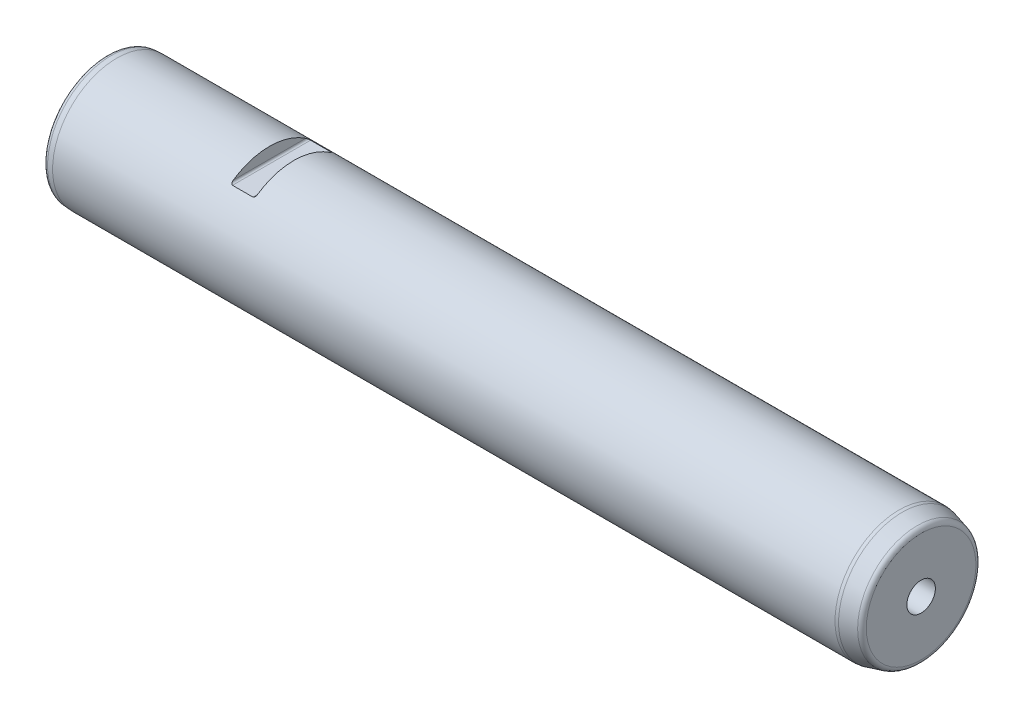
ISO-10303-21;
HEADER;
FILE_DESCRIPTION(('STEP AP214'),'2;1');
FILE_NAME('part.step','',(''),(''),'','','');
FILE_SCHEMA(('AUTOMOTIVE_DESIGN { 1 0 10303 214 1 1 1 1 }'));
ENDSEC;
DATA;
#1=APPLICATION_CONTEXT('core data for automotive mechanical design processes');
#2=APPLICATION_PROTOCOL_DEFINITION('international standard','automotive_design',2000,#1);
#3=PRODUCT_CONTEXT('',#1,'mechanical');
#4=PRODUCT('Part','Part','',(#3));
#5=PRODUCT_RELATED_PRODUCT_CATEGORY('part','',(#4));
#6=PRODUCT_DEFINITION_FORMATION('','',#4);
#7=PRODUCT_DEFINITION_CONTEXT('part definition',#1,'design');
#8=PRODUCT_DEFINITION('design','',#6,#7);
#9=PRODUCT_DEFINITION_SHAPE('','',#8);
#10=(LENGTH_UNIT() NAMED_UNIT(*) SI_UNIT(.MILLI.,.METRE.));
#11=(NAMED_UNIT(*) PLANE_ANGLE_UNIT() SI_UNIT($,.RADIAN.));
#12=(NAMED_UNIT(*) SI_UNIT($,.STERADIAN.) SOLID_ANGLE_UNIT());
#13=UNCERTAINTY_MEASURE_WITH_UNIT(LENGTH_MEASURE(1.E-05),#10,'distance_accuracy_value','');
#14=(GEOMETRIC_REPRESENTATION_CONTEXT(3) GLOBAL_UNCERTAINTY_ASSIGNED_CONTEXT((#13)) GLOBAL_UNIT_ASSIGNED_CONTEXT((#10,
#11,#12)) REPRESENTATION_CONTEXT('',''));
#15=CARTESIAN_POINT('',(0.,0.,0.));
#16=DIRECTION('',(0.,0.,1.));
#17=DIRECTION('',(1.,0.,0.));
#18=AXIS2_PLACEMENT_3D('',#15,#16,#17);
#19=CARTESIAN_POINT('',(0.,0.,0.));
#20=DIRECTION('',(1.,0.,0.));
#21=DIRECTION('',(0.,0.,-1.));
#22=AXIS2_PLACEMENT_3D('',#19,#20,#21);
#23=PLANE('',#22);
#24=CARTESIAN_POINT('',(0.,0.,0.));
#25=DIRECTION('',(1.,0.,0.));
#26=DIRECTION('',(0.,0.,-1.));
#27=AXIS2_PLACEMENT_3D('',#24,#25,#26);
#28=CIRCLE('',#27,28.771728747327);
#29=CARTESIAN_POINT('',(0.,0.,-28.771728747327));
#30=VERTEX_POINT('',#29);
#31=EDGE_CURVE('E160',#30,#30,#28,.F.);
#32=ORIENTED_EDGE('',*,*,#31,.T.);
#33=EDGE_LOOP('',(#32));
#34=FACE_BOUND('',#33,.T.);
#35=ADVANCED_FACE('F15',(#34),#23,.F.);
#36=CARTESIAN_POINT('',(0.,0.,0.));
#37=DIRECTION('',(-1.,0.,0.));
#38=DIRECTION('',(0.,0.,1.));
#39=AXIS2_PLACEMENT_3D('',#36,#37,#38);
#40=CYLINDRICAL_SURFACE('',#39,31.5);
#41=CARTESIAN_POINT('',(91.,25.,-19.1637678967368));
#42=CARTESIAN_POINT('',(91.0206021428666,24.9999962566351,-19.1637724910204));
#43=CARTESIAN_POINT('',(91.0411895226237,25.000637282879,-19.1629365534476));
#44=CARTESIAN_POINT('',(91.0821323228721,25.0031684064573,-19.1596340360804));
#45=CARTESIAN_POINT('',(91.1024879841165,25.0050570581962,-19.1571693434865));
#46=CARTESIAN_POINT('',(91.1624864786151,25.0124756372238,-19.1474836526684));
#47=CARTESIAN_POINT('',(91.2015690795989,25.0197603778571,-19.1379682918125));
#48=CARTESIAN_POINT('',(91.2768030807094,25.0382921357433,-19.1137163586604));
#49=CARTESIAN_POINT('',(91.3129662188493,25.0495222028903,-19.0990021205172));
#50=CARTESIAN_POINT('',(91.3821411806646,25.0751576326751,-19.0653329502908));
#51=CARTESIAN_POINT('',(91.4151429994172,25.0895726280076,-19.0463651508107));
#52=CARTESIAN_POINT('',(91.4940924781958,25.1289598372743,-18.9943915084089));
#53=CARTESIAN_POINT('',(91.5378167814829,25.1555174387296,-18.9592231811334));
#54=CARTESIAN_POINT('',(91.6178752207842,25.2121909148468,-18.8837940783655));
#55=CARTESIAN_POINT('',(91.654194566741,25.2423137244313,-18.8435233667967));
#56=CARTESIAN_POINT('',(91.7400427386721,25.323512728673,-18.7343708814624));
#57=CARTESIAN_POINT('',(91.7844613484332,25.3763362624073,-18.6627946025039));
#58=CARTESIAN_POINT('',(91.8595737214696,25.4847393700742,-18.5144966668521));
#59=CARTESIAN_POINT('',(91.8902090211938,25.5403295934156,-18.437754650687));
#60=CARTESIAN_POINT('',(91.9297784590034,25.6300581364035,-18.3126586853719));
#61=CARTESIAN_POINT('',(91.9424916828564,25.6638849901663,-18.2652250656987));
#62=CARTESIAN_POINT('',(91.963993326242,25.7317021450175,-18.1695608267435));
#63=CARTESIAN_POINT('',(91.9727802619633,25.7656925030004,-18.121329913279));
#64=CARTESIAN_POINT('',(91.9865826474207,25.8331875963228,-18.0249779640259));
#65=CARTESIAN_POINT('',(91.9916469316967,25.866692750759,-17.9768640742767));
#66=CARTESIAN_POINT('',(91.9983485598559,25.9335124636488,-17.8803351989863));
#67=CARTESIAN_POINT('',(91.9999892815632,25.9668271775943,-17.8319205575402));
#68=CARTESIAN_POINT('',(92.,26.,-17.7834192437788));
#69=B_SPLINE_CURVE_WITH_KNOTS('',3,(#41,#42,#43,#44,#45,#46,#47,#48,#49,#50,#51,#52,#53,#54,#55,
#56,#57,#58,#59,#60,#61,#62,#63,#64,#65,#66,#67,#68),.UNSPECIFIED.,.F.,.F.,(4,2,2,2,2,2,2,2,2,2,
2,2,2,4),(0.,0.0617521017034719,0.123432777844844,0.245296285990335,0.366642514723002,
0.488360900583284,0.673551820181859,0.859109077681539,1.15576169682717,1.45366100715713,
1.63242917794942,1.81126485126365,1.98771047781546,2.16398193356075),.UNSPECIFIED.);
#70=CARTESIAN_POINT('',(91.,25.,-19.1637678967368));
#71=VERTEX_POINT('',#70);
#72=CARTESIAN_POINT('',(92.,26.,-17.7834192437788));
#73=VERTEX_POINT('',#72);
#74=EDGE_CURVE('E206',#71,#73,#69,.T.);
#75=ORIENTED_EDGE('',*,*,#74,.T.);
#76=CARTESIAN_POINT('',(92.,0.,0.));
#77=DIRECTION('',(1.,0.,0.));
#78=DIRECTION('',(0.,0.,-1.));
#79=AXIS2_PLACEMENT_3D('',#76,#77,#78);
#80=CIRCLE('',#79,31.5);
#81=CARTESIAN_POINT('',(92.,26.,17.7834192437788));
#82=VERTEX_POINT('',#81);
#83=EDGE_CURVE('E9',#73,#82,#80,.T.);
#84=ORIENTED_EDGE('',*,*,#83,.T.);
#85=CARTESIAN_POINT('',(92.,26.,17.7834192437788));
#86=CARTESIAN_POINT('',(91.9999572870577,25.9536837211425,17.8511416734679));
#87=CARTESIAN_POINT('',(91.9967773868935,25.9070697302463,17.9187190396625));
#88=CARTESIAN_POINT('',(91.98359435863,25.8134163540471,18.0533717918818));
#89=CARTESIAN_POINT('',(91.9735592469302,25.7663759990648,18.1204433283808));
#90=CARTESIAN_POINT('',(91.9459716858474,25.672018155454,18.2538828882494));
#91=CARTESIAN_POINT('',(91.9283458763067,25.6247025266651,18.3202373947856));
#92=CARTESIAN_POINT('',(91.8846961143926,25.5309760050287,18.450628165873));
#93=CARTESIAN_POINT('',(91.8586908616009,25.4845633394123,18.5146692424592));
#94=CARTESIAN_POINT('',(91.8035708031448,25.4032208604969,18.6260588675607));
#95=CARTESIAN_POINT('',(91.7762945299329,25.3679487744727,18.6740601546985));
#96=CARTESIAN_POINT('',(91.7149053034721,25.2992635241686,18.7670081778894));
#97=CARTESIAN_POINT('',(91.6807928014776,25.2658502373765,18.8119551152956));
#98=CARTESIAN_POINT('',(91.6042482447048,25.2016125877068,18.8979268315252));
#99=CARTESIAN_POINT('',(91.5617053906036,25.1708315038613,18.9388871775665));
#100=CARTESIAN_POINT('',(91.4677411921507,25.1144557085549,19.0135816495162));
#101=CARTESIAN_POINT('',(91.4163575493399,25.0888399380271,19.0473451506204));
#102=CARTESIAN_POINT('',(91.3286773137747,25.0549354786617,19.0918997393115));
#103=CARTESIAN_POINT('',(91.2952896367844,25.0439158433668,19.1063475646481));
#104=CARTESIAN_POINT('',(91.2260723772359,25.0252341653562,19.1308099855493));
#105=CARTESIAN_POINT('',(91.1902489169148,25.0175640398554,19.1408352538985));
#106=CARTESIAN_POINT('',(91.1285741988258,25.0079765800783,19.1533587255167));
#107=CARTESIAN_POINT('',(91.1031595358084,25.0050065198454,19.1572353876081));
#108=CARTESIAN_POINT('',(91.0518392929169,25.001008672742,19.1624520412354));
#109=CARTESIAN_POINT('',(91.0259323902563,24.9999872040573,19.1637837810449));
#110=CARTESIAN_POINT('',(91.,25.,19.1637678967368));
#111=B_SPLINE_CURVE_WITH_KNOTS('',3,(#85,#86,#87,#88,#89,#90,#91,#92,#93,#94,#95,#96,#97,#98,
#99,#100,#101,#102,#103,#104,#105,#106,#107,#108,#109,#110),.UNSPECIFIED.,.F.,.F.,(4,2,2,2,2,2,
2,2,2,2,2,2,4),(0.,0.2461520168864,0.493460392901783,0.743214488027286,0.992415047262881,
1.18859975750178,1.38477152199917,1.58371665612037,1.78183351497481,1.8954759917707,
2.00884269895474,2.0862906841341,2.16398936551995),.UNSPECIFIED.);
#112=CARTESIAN_POINT('',(91.,25.,19.1637678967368));
#113=VERTEX_POINT('',#112);
#114=EDGE_CURVE('E23',#82,#113,#111,.T.);
#115=ORIENTED_EDGE('',*,*,#114,.T.);
#116=DIRECTION('',(-1.,0.,0.));
#117=VECTOR('',#116,1.);
#118=CARTESIAN_POINT('',(0.,25.,19.1637678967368));
#119=LINE('',#118,#117);
#120=CARTESIAN_POINT('',(81.,25.,19.1637678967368));
#121=VERTEX_POINT('',#120);
#122=EDGE_CURVE('E74',#113,#121,#119,.T.);
#123=ORIENTED_EDGE('',*,*,#122,.T.);
#124=CARTESIAN_POINT('',(81.,25.,19.1637678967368));
#125=CARTESIAN_POINT('',(80.9793978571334,24.9999962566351,19.1637724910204));
#126=CARTESIAN_POINT('',(80.9588104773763,25.000637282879,19.1629365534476));
#127=CARTESIAN_POINT('',(80.9178676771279,25.0031684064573,19.1596340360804));
#128=CARTESIAN_POINT('',(80.8975120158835,25.0050570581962,19.1571693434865));
#129=CARTESIAN_POINT('',(80.8375135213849,25.0124756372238,19.1474836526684));
#130=CARTESIAN_POINT('',(80.7984309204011,25.0197603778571,19.1379682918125));
#131=CARTESIAN_POINT('',(80.7231969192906,25.0382921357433,19.1137163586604));
#132=CARTESIAN_POINT('',(80.6870337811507,25.0495222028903,19.0990021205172));
#133=CARTESIAN_POINT('',(80.6178588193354,25.0751576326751,19.0653329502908));
#134=CARTESIAN_POINT('',(80.5848570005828,25.0895726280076,19.0463651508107));
#135=CARTESIAN_POINT('',(80.5059075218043,25.1289598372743,18.9943915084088));
#136=CARTESIAN_POINT('',(80.4621832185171,25.1555174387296,18.9592231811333));
#137=CARTESIAN_POINT('',(80.3821247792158,25.2121909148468,18.8837940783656));
#138=CARTESIAN_POINT('',(80.345805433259,25.2423137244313,18.8435233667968));
#139=CARTESIAN_POINT('',(80.2599572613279,25.3235127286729,18.7343708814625));
#140=CARTESIAN_POINT('',(80.2155386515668,25.3763362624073,18.662794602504));
#141=CARTESIAN_POINT('',(80.1404262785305,25.4847393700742,18.5144966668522));
#142=CARTESIAN_POINT('',(80.1097909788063,25.5403295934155,18.437754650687));
#143=CARTESIAN_POINT('',(80.0702215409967,25.6300581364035,18.3126586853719));
#144=CARTESIAN_POINT('',(80.0575083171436,25.6638849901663,18.2652250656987));
#145=CARTESIAN_POINT('',(80.0360066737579,25.7317021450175,18.1695608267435));
#146=CARTESIAN_POINT('',(80.0272197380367,25.7656925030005,18.121329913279));
#147=CARTESIAN_POINT('',(80.0134173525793,25.8331875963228,18.0249779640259));
#148=CARTESIAN_POINT('',(80.0083530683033,25.866692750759,17.9768640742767));
#149=CARTESIAN_POINT('',(80.0016514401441,25.9335124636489,17.8803351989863));
#150=CARTESIAN_POINT('',(80.0000107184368,25.9668271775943,17.8319205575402));
#151=CARTESIAN_POINT('',(80.,26.,17.7834192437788));
#152=B_SPLINE_CURVE_WITH_KNOTS('',3,(#124,#125,#126,#127,#128,#129,#130,#131,#132,#133,#134,
#135,#136,#137,#138,#139,#140,#141,#142,#143,#144,#145,#146,#147,#148,#149,#150,#151),
.UNSPECIFIED.,.F.,.F.,(4,2,2,2,2,2,2,2,2,2,2,2,2,4),(0.,0.061752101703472,0.123432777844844,
0.245296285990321,0.366642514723,0.488360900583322,0.673551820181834,0.859109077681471,
1.15576169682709,1.45366100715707,1.6324291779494,1.81126485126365,1.98771047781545,
2.16398193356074),.UNSPECIFIED.);
#153=CARTESIAN_POINT('',(80.,26.,17.7834192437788));
#154=VERTEX_POINT('',#153);
#155=EDGE_CURVE('E65',#121,#154,#152,.T.);
#156=ORIENTED_EDGE('',*,*,#155,.T.);
#157=CARTESIAN_POINT('',(80.,0.,0.));
#158=DIRECTION('',(-1.,0.,0.));
#159=DIRECTION('',(0.,-1.,0.));
#160=AXIS2_PLACEMENT_3D('',#157,#158,#159);
#161=CIRCLE('',#160,31.5);
#162=CARTESIAN_POINT('',(80.,26.,-17.7834192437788));
#163=VERTEX_POINT('',#162);
#164=EDGE_CURVE('E54',#154,#163,#161,.T.);
#165=ORIENTED_EDGE('',*,*,#164,.T.);
#166=CARTESIAN_POINT('',(80.,26.,-17.7834192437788));
#167=CARTESIAN_POINT('',(80.0000427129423,25.9536837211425,-17.8511416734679));
#168=CARTESIAN_POINT('',(80.0032226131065,25.9070697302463,-17.9187190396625));
#169=CARTESIAN_POINT('',(80.01640564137,25.8134163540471,-18.0533717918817));
#170=CARTESIAN_POINT('',(80.0264407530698,25.7663759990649,-18.1204433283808));
#171=CARTESIAN_POINT('',(80.0540283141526,25.672018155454,-18.2538828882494));
#172=CARTESIAN_POINT('',(80.0716541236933,25.6247025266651,-18.3202373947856));
#173=CARTESIAN_POINT('',(80.1153038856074,25.5309760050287,-18.450628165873));
#174=CARTESIAN_POINT('',(80.1413091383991,25.4845633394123,-18.5146692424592));
#175=CARTESIAN_POINT('',(80.1964291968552,25.4032208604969,-18.6260588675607));
#176=CARTESIAN_POINT('',(80.2237054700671,25.3679487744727,-18.6740601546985));
#177=CARTESIAN_POINT('',(80.2850946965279,25.2992635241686,-18.7670081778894));
#178=CARTESIAN_POINT('',(80.3192071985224,25.2658502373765,-18.8119551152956));
#179=CARTESIAN_POINT('',(80.3957517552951,25.2016125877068,-18.8979268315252));
#180=CARTESIAN_POINT('',(80.4382946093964,25.1708315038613,-18.9388871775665));
#181=CARTESIAN_POINT('',(80.5322588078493,25.1144557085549,-19.0135816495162));
#182=CARTESIAN_POINT('',(80.5836424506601,25.0888399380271,-19.0473451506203));
#183=CARTESIAN_POINT('',(80.6713226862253,25.0549354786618,-19.0918997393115));
#184=CARTESIAN_POINT('',(80.7047103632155,25.0439158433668,-19.106347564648));
#185=CARTESIAN_POINT('',(80.7739276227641,25.0252341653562,-19.1308099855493));
#186=CARTESIAN_POINT('',(80.8097510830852,25.0175640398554,-19.1408352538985));
#187=CARTESIAN_POINT('',(80.8714258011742,25.0079765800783,-19.1533587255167));
#188=CARTESIAN_POINT('',(80.8968404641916,25.0050065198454,-19.1572353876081));
#189=CARTESIAN_POINT('',(80.9481607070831,25.001008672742,-19.1624520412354));
#190=CARTESIAN_POINT('',(80.9740676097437,24.9999872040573,-19.1637837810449));
#191=CARTESIAN_POINT('',(81.,25.,-19.1637678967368));
#192=B_SPLINE_CURVE_WITH_KNOTS('',3,(#166,#167,#168,#169,#170,#171,#172,#173,#174,#175,#176,
#177,#178,#179,#180,#181,#182,#183,#184,#185,#186,#187,#188,#189,#190,#191),.UNSPECIFIED.,.F.,
.F.,(4,2,2,2,2,2,2,2,2,2,2,2,4),(0.,0.246152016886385,0.493460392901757,0.743214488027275,
0.992415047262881,1.18859975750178,1.38477152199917,1.58371665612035,1.78183351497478,
1.89547599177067,2.00884269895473,2.08629068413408,2.16398936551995),.UNSPECIFIED.);
#193=CARTESIAN_POINT('',(81.,25.,-19.1637678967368));
#194=VERTEX_POINT('',#193);
#195=EDGE_CURVE('E59',#163,#194,#192,.T.);
#196=ORIENTED_EDGE('',*,*,#195,.T.);
#197=DIRECTION('',(-1.,0.,0.));
#198=VECTOR('',#197,1.);
#199=CARTESIAN_POINT('',(0.,25.,-19.1637678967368));
#200=LINE('',#199,#198);
#201=EDGE_CURVE('E75',#194,#71,#200,.F.);
#202=ORIENTED_EDGE('',*,*,#201,.T.);
#203=EDGE_LOOP('',(#75,#84,#115,#123,#156,#165,#196,#202));
#204=FACE_BOUND('',#203,.T.);
#205=CARTESIAN_POINT('',(4.99999999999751,0.,0.));
#206=DIRECTION('',(1.,0.,0.));
#207=DIRECTION('',(0.,0.,-1.));
#208=AXIS2_PLACEMENT_3D('',#205,#206,#207);
#209=CIRCLE('',#208,31.5);
#210=CARTESIAN_POINT('',(4.99999999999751,0.,-31.5));
#211=VERTEX_POINT('',#210);
#212=EDGE_CURVE('E159',#211,#211,#209,.T.);
#213=ORIENTED_EDGE('',*,*,#212,.T.);
#214=EDGE_LOOP('',(#213));
#215=FACE_BOUND('',#214,.T.);
#216=CARTESIAN_POINT('',(389.210085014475,0.,0.));
#217=DIRECTION('',(1.,0.,0.));
#218=DIRECTION('',(0.,0.,-1.));
#219=AXIS2_PLACEMENT_3D('',#216,#217,#218);
#220=CIRCLE('',#219,31.5);
#221=CARTESIAN_POINT('',(389.210085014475,0.,-31.5));
#222=VERTEX_POINT('',#221);
#223=EDGE_CURVE('E177',#222,#222,#220,.F.);
#224=ORIENTED_EDGE('',*,*,#223,.T.);
#225=EDGE_LOOP('',(#224));
#226=FACE_BOUND('',#225,.T.);
#227=ADVANCED_FACE('F71',(#204,#215,#226),#40,.T.);
#228=CARTESIAN_POINT('',(400.,0.,0.));
#229=DIRECTION('',(-1.,0.,0.));
#230=DIRECTION('',(0.,0.,1.));
#231=AXIS2_PLACEMENT_3D('',#228,#229,#230);
#232=CONICAL_SURFACE('',#231,28.8205080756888,0.26179938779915);
#233=CARTESIAN_POINT('',(398.147047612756,0.,0.));
#234=DIRECTION('',(1.,0.,0.));
#235=DIRECTION('',(0.,0.,-1.));
#236=AXIS2_PLACEMENT_3D('',#233,#234,#235);
#237=CIRCLE('',#236,29.3170051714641);
#238=CARTESIAN_POINT('',(398.147047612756,0.,-29.3170051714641));
#239=VERTEX_POINT('',#238);
#240=EDGE_CURVE('E165',#239,#239,#237,.F.);
#241=ORIENTED_EDGE('',*,*,#240,.T.);
#242=EDGE_LOOP('',(#241));
#243=FACE_BOUND('',#242,.T.);
#244=CARTESIAN_POINT('',(390.762999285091,0.,0.));
#245=DIRECTION('',(1.,0.,0.));
#246=DIRECTION('',(0.,0.,-1.));
#247=AXIS2_PLACEMENT_3D('',#244,#245,#246);
#248=CIRCLE('',#247,31.2955549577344);
#249=CARTESIAN_POINT('',(390.762999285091,0.,-31.2955549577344));
#250=VERTEX_POINT('',#249);
#251=EDGE_CURVE('E190',#250,#250,#248,.T.);
#252=ORIENTED_EDGE('',*,*,#251,.T.);
#253=EDGE_LOOP('',(#252));
#254=FACE_BOUND('',#253,.T.);
#255=ADVANCED_FACE('F122',(#243,#254),#232,.T.);
#256=CARTESIAN_POINT('',(400.,28.8205080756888,0.));
#257=DIRECTION('',(-1.,0.,0.));
#258=DIRECTION('',(0.,0.,1.));
#259=AXIS2_PLACEMENT_3D('',#256,#257,#258);
#260=PLANE('',#259);
#261=CARTESIAN_POINT('',(400.,0.,0.));
#262=DIRECTION('',(1.,0.,0.));
#263=DIRECTION('',(0.,0.,-1.));
#264=AXIS2_PLACEMENT_3D('',#261,#262,#263);
#265=CIRCLE('',#264,7.);
#266=CARTESIAN_POINT('',(400.,0.,-7.));
#267=VERTEX_POINT('',#266);
#268=EDGE_CURVE('E180',#267,#267,#265,.T.);
#269=ORIENTED_EDGE('',*,*,#268,.F.);
#270=EDGE_LOOP('',(#269));
#271=FACE_BOUND('',#270,.T.);
#272=CARTESIAN_POINT('',(400.,0.,0.));
#273=DIRECTION('',(-1.,0.,0.));
#274=DIRECTION('',(0.,0.,1.));
#275=AXIS2_PLACEMENT_3D('',#272,#273,#274);
#276=CIRCLE('',#275,26.9021906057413);
#277=CARTESIAN_POINT('',(400.,0.,26.9021906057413));
#278=VERTEX_POINT('',#277);
#279=EDGE_CURVE('E161',#278,#278,#276,.F.);
#280=ORIENTED_EDGE('',*,*,#279,.T.);
#281=EDGE_LOOP('',(#280));
#282=FACE_BOUND('',#281,.T.);
#283=ADVANCED_FACE('F119',(#271,#282),#260,.F.);
#284=CARTESIAN_POINT('',(389.210085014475,0.,0.));
#285=DIRECTION('',(1.,0.,0.));
#286=DIRECTION('',(0.,0.,-1.));
#287=AXIS2_PLACEMENT_3D('',#284,#285,#286);
#288=TOROIDAL_SURFACE('',#287,25.5,6.);
#289=ORIENTED_EDGE('',*,*,#251,.F.);
#290=EDGE_LOOP('',(#289));
#291=FACE_BOUND('',#290,.T.);
#292=ORIENTED_EDGE('',*,*,#223,.F.);
#293=EDGE_LOOP('',(#292));
#294=FACE_BOUND('',#293,.T.);
#295=ADVANCED_FACE('F121',(#291,#294),#288,.T.);
#296=CARTESIAN_POINT('',(397.5,0.,0.));
#297=DIRECTION('',(-1.,0.,0.));
#298=DIRECTION('',(0.,0.,1.));
#299=AXIS2_PLACEMENT_3D('',#296,#297,#298);
#300=TOROIDAL_SURFACE('',#299,26.9021906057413,2.5);
#301=ORIENTED_EDGE('',*,*,#279,.F.);
#302=EDGE_LOOP('',(#301));
#303=FACE_BOUND('',#302,.T.);
#304=ORIENTED_EDGE('',*,*,#240,.F.);
#305=EDGE_LOOP('',(#304));
#306=FACE_BOUND('',#305,.T.);
#307=ADVANCED_FACE('F142',(#303,#306),#300,.T.);
#308=CARTESIAN_POINT('',(0.,0.,0.));
#309=DIRECTION('',(1.,0.,0.));
#310=DIRECTION('',(0.,0.,-1.));
#311=AXIS2_PLACEMENT_3D('',#308,#309,#310);
#312=CONICAL_SURFACE('',#311,31.0625566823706,0.0872664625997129);
#313=CARTESIAN_POINT('',(2.28211064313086,0.,0.));
#314=DIRECTION('',(1.,0.,0.));
#315=DIRECTION('',(0.,0.,-1.));
#316=AXIS2_PLACEMENT_3D('',#313,#314,#315);
#317=CIRCLE('',#316,31.2622154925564);
#318=CARTESIAN_POINT('',(2.28211064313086,0.,-31.2622154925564));
#319=VERTEX_POINT('',#318);
#320=EDGE_CURVE('E60',#319,#319,#317,.T.);
#321=ORIENTED_EDGE('',*,*,#320,.T.);
#322=EDGE_LOOP('',(#321));
#323=FACE_BOUND('',#322,.T.);
#324=ORIENTED_EDGE('',*,*,#212,.F.);
#325=EDGE_LOOP('',(#324));
#326=FACE_BOUND('',#325,.T.);
#327=ADVANCED_FACE('F145',(#323,#326),#312,.T.);
#328=CARTESIAN_POINT('',(2.5,0.,0.));
#329=DIRECTION('',(1.,0.,0.));
#330=DIRECTION('',(0.,0.,-1.));
#331=AXIS2_PLACEMENT_3D('',#328,#329,#330);
#332=TOROIDAL_SURFACE('',#331,28.771728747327,2.5);
#333=ORIENTED_EDGE('',*,*,#320,.F.);
#334=EDGE_LOOP('',(#333));
#335=FACE_BOUND('',#334,.T.);
#336=ORIENTED_EDGE('',*,*,#31,.F.);
#337=EDGE_LOOP('',(#336));
#338=FACE_BOUND('',#337,.T.);
#339=ADVANCED_FACE('F17',(#335,#338),#332,.T.);
#340=CARTESIAN_POINT('',(376.,0.,0.));
#341=DIRECTION('',(1.,0.,0.));
#342=DIRECTION('',(0.,0.,-1.));
#343=AXIS2_PLACEMENT_3D('',#340,#341,#342);
#344=PLANE('',#343);
#345=CARTESIAN_POINT('',(376.,0.,0.));
#346=DIRECTION('',(1.,0.,0.));
#347=DIRECTION('',(0.,0.,-1.));
#348=AXIS2_PLACEMENT_3D('',#345,#346,#347);
#349=CIRCLE('',#348,7.);
#350=CARTESIAN_POINT('',(376.,0.,-7.));
#351=VERTEX_POINT('',#350);
#352=EDGE_CURVE('E173',#351,#351,#349,.T.);
#353=ORIENTED_EDGE('',*,*,#352,.T.);
#354=EDGE_LOOP('',(#353));
#355=FACE_BOUND('',#354,.T.);
#356=CARTESIAN_POINT('',(376.,0.,0.));
#357=DIRECTION('',(1.,0.,0.));
#358=DIRECTION('',(0.,0.,-1.));
#359=AXIS2_PLACEMENT_3D('',#356,#357,#358);
#360=CIRCLE('',#359,5.1);
#361=CARTESIAN_POINT('',(376.,0.,-5.1));
#362=VERTEX_POINT('',#361);
#363=EDGE_CURVE('E170',#362,#362,#360,.F.);
#364=ORIENTED_EDGE('',*,*,#363,.T.);
#365=EDGE_LOOP('',(#364));
#366=FACE_BOUND('',#365,.T.);
#367=ADVANCED_FACE('F103',(#355,#366),#344,.T.);
#368=CARTESIAN_POINT('',(376.,0.,0.));
#369=DIRECTION('',(1.,0.,0.));
#370=DIRECTION('',(0.,0.,-1.));
#371=AXIS2_PLACEMENT_3D('',#368,#369,#370);
#372=CYLINDRICAL_SURFACE('',#371,7.);
#373=ORIENTED_EDGE('',*,*,#352,.F.);
#374=EDGE_LOOP('',(#373));
#375=FACE_BOUND('',#374,.T.);
#376=ORIENTED_EDGE('',*,*,#268,.T.);
#377=EDGE_LOOP('',(#376));
#378=FACE_BOUND('',#377,.T.);
#379=ADVANCED_FACE('F106',(#375,#378),#372,.F.);
#380=CARTESIAN_POINT('',(370.,0.,0.));
#381=DIRECTION('',(1.,0.,0.));
#382=DIRECTION('',(0.,0.,-1.));
#383=AXIS2_PLACEMENT_3D('',#380,#381,#382);
#384=CONICAL_SURFACE('',#383,5.1,1.0471975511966);
#385=CARTESIAN_POINT('',(367.055513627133,0.,0.));
#386=VERTEX_POINT('',#385);
#387=VERTEX_LOOP('',#386);
#388=FACE_BOUND('',#387,.T.);
#389=CARTESIAN_POINT('',(370.,0.,0.));
#390=DIRECTION('',(1.,0.,0.));
#391=DIRECTION('',(0.,0.,-1.));
#392=AXIS2_PLACEMENT_3D('',#389,#390,#391);
#393=CIRCLE('',#392,5.1);
#394=CARTESIAN_POINT('',(370.,0.,-5.1));
#395=VERTEX_POINT('',#394);
#396=EDGE_CURVE('E172',#395,#395,#393,.T.);
#397=ORIENTED_EDGE('',*,*,#396,.T.);
#398=EDGE_LOOP('',(#397));
#399=FACE_BOUND('',#398,.T.);
#400=ADVANCED_FACE('F110',(#388,#399),#384,.F.);
#401=CARTESIAN_POINT('',(400.,0.,0.));
#402=DIRECTION('',(1.,0.,0.));
#403=DIRECTION('',(0.,0.,-1.));
#404=AXIS2_PLACEMENT_3D('',#401,#402,#403);
#405=CYLINDRICAL_SURFACE('',#404,5.1);
#406=ORIENTED_EDGE('',*,*,#396,.F.);
#407=EDGE_LOOP('',(#406));
#408=FACE_BOUND('',#407,.T.);
#409=ORIENTED_EDGE('',*,*,#363,.F.);
#410=EDGE_LOOP('',(#409));
#411=FACE_BOUND('',#410,.T.);
#412=ADVANCED_FACE('F112',(#408,#411),#405,.F.);
#413=CARTESIAN_POINT('',(92.,26.,-31.5));
#414=DIRECTION('',(1.,0.,0.));
#415=DIRECTION('',(0.,0.,-1.));
#416=AXIS2_PLACEMENT_3D('',#413,#414,#415);
#417=PLANE('',#416);
#418=DIRECTION('',(0.,0.,1.));
#419=VECTOR('',#418,1.);
#420=CARTESIAN_POINT('',(92.,26.,-31.5));
#421=LINE('',#420,#419);
#422=EDGE_CURVE('E184',#73,#82,#421,.T.);
#423=ORIENTED_EDGE('',*,*,#422,.T.);
#424=ORIENTED_EDGE('',*,*,#83,.F.);
#425=EDGE_LOOP('',(#423,#424));
#426=FACE_BOUND('',#425,.T.);
#427=ADVANCED_FACE('F115',(#426),#417,.F.);
#428=CARTESIAN_POINT('',(91.,26.,-31.5));
#429=DIRECTION('',(0.,0.,1.));
#430=DIRECTION('',(1.,0.,0.));
#431=AXIS2_PLACEMENT_3D('',#428,#429,#430);
#432=CYLINDRICAL_SURFACE('',#431,1.);
#433=ORIENTED_EDGE('',*,*,#422,.F.);
#434=ORIENTED_EDGE('',*,*,#74,.F.);
#435=DIRECTION('',(0.,0.,1.));
#436=VECTOR('',#435,1.);
#437=CARTESIAN_POINT('',(91.,25.,-31.5));
#438=LINE('',#437,#436);
#439=EDGE_CURVE('E199',#71,#113,#438,.T.);
#440=ORIENTED_EDGE('',*,*,#439,.T.);
#441=ORIENTED_EDGE('',*,*,#114,.F.);
#442=EDGE_LOOP('',(#433,#434,#440,#441));
#443=FACE_BOUND('',#442,.T.);
#444=ADVANCED_FACE('F217',(#443),#432,.F.);
#445=CARTESIAN_POINT('',(81.,25.,-31.5));
#446=DIRECTION('',(0.,-1.,0.));
#447=DIRECTION('',(0.,0.,-1.));
#448=AXIS2_PLACEMENT_3D('',#445,#446,#447);
#449=PLANE('',#448);
#450=ORIENTED_EDGE('',*,*,#439,.F.);
#451=ORIENTED_EDGE('',*,*,#201,.F.);
#452=DIRECTION('',(0.,0.,1.));
#453=VECTOR('',#452,1.);
#454=CARTESIAN_POINT('',(81.,25.,-31.5));
#455=LINE('',#454,#453);
#456=EDGE_CURVE('E67',#194,#121,#455,.T.);
#457=ORIENTED_EDGE('',*,*,#456,.T.);
#458=ORIENTED_EDGE('',*,*,#122,.F.);
#459=EDGE_LOOP('',(#450,#451,#457,#458));
#460=FACE_BOUND('',#459,.T.);
#461=ADVANCED_FACE('F98',(#460),#449,.F.);
#462=CARTESIAN_POINT('',(81.,26.,-31.5));
#463=DIRECTION('',(0.,0.,1.));
#464=DIRECTION('',(1.,0.,0.));
#465=AXIS2_PLACEMENT_3D('',#462,#463,#464);
#466=CYLINDRICAL_SURFACE('',#465,1.);
#467=ORIENTED_EDGE('',*,*,#456,.F.);
#468=ORIENTED_EDGE('',*,*,#195,.F.);
#469=DIRECTION('',(0.,0.,1.));
#470=VECTOR('',#469,1.);
#471=CARTESIAN_POINT('',(80.,26.,-31.5));
#472=LINE('',#471,#470);
#473=EDGE_CURVE('E29',#163,#154,#472,.T.);
#474=ORIENTED_EDGE('',*,*,#473,.T.);
#475=ORIENTED_EDGE('',*,*,#155,.F.);
#476=EDGE_LOOP('',(#467,#468,#474,#475));
#477=FACE_BOUND('',#476,.T.);
#478=ADVANCED_FACE('F64',(#477),#466,.F.);
#479=CARTESIAN_POINT('',(80.,31.5,-31.5));
#480=DIRECTION('',(-1.,0.,0.));
#481=DIRECTION('',(0.,-1.,0.));
#482=AXIS2_PLACEMENT_3D('',#479,#480,#481);
#483=PLANE('',#482);
#484=ORIENTED_EDGE('',*,*,#473,.F.);
#485=ORIENTED_EDGE('',*,*,#164,.F.);
#486=EDGE_LOOP('',(#484,#485));
#487=FACE_BOUND('',#486,.T.);
#488=ADVANCED_FACE('F55',(#487),#483,.F.);
#489=CLOSED_SHELL('',(#35,#227,#255,#283,#295,#307,#327,#339,#367,#379,#400,#412,#427,#444,#461,
#478,#488));
#490=MANIFOLD_SOLID_BREP('B1',#489);
#491=ADVANCED_BREP_SHAPE_REPRESENTATION('',(#18,#490),#14);
#492=SHAPE_DEFINITION_REPRESENTATION(#9,#491);
ENDSEC;
END-ISO-10303-21;
